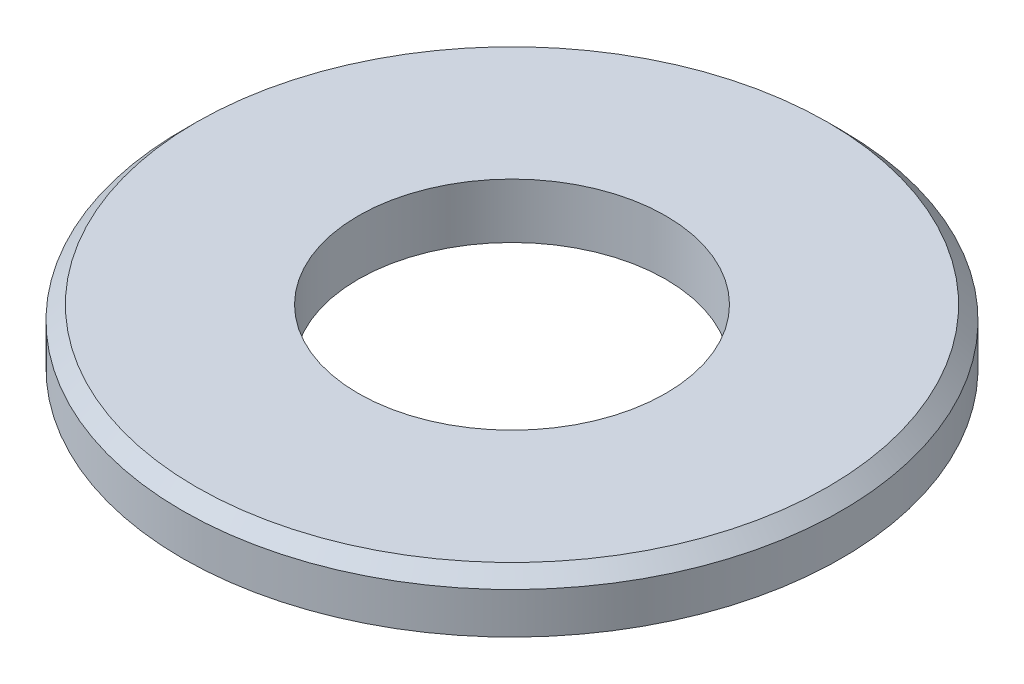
ISO-10303-21;
HEADER;
FILE_DESCRIPTION(('STEP AP214'),'2;1');
FILE_NAME('part.step','',(''),(''),'','','');
FILE_SCHEMA(('AUTOMOTIVE_DESIGN { 1 0 10303 214 1 1 1 1 }'));
ENDSEC;
DATA;
#1=APPLICATION_CONTEXT('core data for automotive mechanical design processes');
#2=APPLICATION_PROTOCOL_DEFINITION('international standard','automotive_design',2000,#1);
#3=PRODUCT_CONTEXT('',#1,'mechanical');
#4=PRODUCT('Part','Part','',(#3));
#5=PRODUCT_RELATED_PRODUCT_CATEGORY('part','',(#4));
#6=PRODUCT_DEFINITION_FORMATION('','',#4);
#7=PRODUCT_DEFINITION_CONTEXT('part definition',#1,'design');
#8=PRODUCT_DEFINITION('design','',#6,#7);
#9=PRODUCT_DEFINITION_SHAPE('','',#8);
#10=(LENGTH_UNIT() NAMED_UNIT(*) SI_UNIT(.MILLI.,.METRE.));
#11=(NAMED_UNIT(*) PLANE_ANGLE_UNIT() SI_UNIT($,.RADIAN.));
#12=(NAMED_UNIT(*) SI_UNIT($,.STERADIAN.) SOLID_ANGLE_UNIT());
#13=UNCERTAINTY_MEASURE_WITH_UNIT(LENGTH_MEASURE(1.E-05),#10,'distance_accuracy_value','');
#14=(GEOMETRIC_REPRESENTATION_CONTEXT(3) GLOBAL_UNCERTAINTY_ASSIGNED_CONTEXT((#13)) GLOBAL_UNIT_ASSIGNED_CONTEXT((#10,
#11,#12)) REPRESENTATION_CONTEXT('',''));
#15=CARTESIAN_POINT('',(0.,0.,0.));
#16=DIRECTION('',(0.,0.,1.));
#17=DIRECTION('',(1.,0.,0.));
#18=AXIS2_PLACEMENT_3D('',#15,#16,#17);
#19=CARTESIAN_POINT('',(0.,1.5,0.));
#20=DIRECTION('',(0.,1.,0.));
#21=DIRECTION('',(0.,0.,1.));
#22=AXIS2_PLACEMENT_3D('',#19,#20,#21);
#23=PLANE('',#22);
#24=CARTESIAN_POINT('',(0.,1.5,0.));
#25=DIRECTION('',(0.,1.,0.));
#26=DIRECTION('',(0.,0.,1.));
#27=AXIS2_PLACEMENT_3D('',#24,#25,#26);
#28=CIRCLE('',#27,8.625);
#29=CARTESIAN_POINT('',(0.,1.5,-8.625));
#30=VERTEX_POINT('',#29);
#31=EDGE_CURVE('E46',#30,#30,#28,.T.);
#32=ORIENTED_EDGE('',*,*,#31,.T.);
#33=EDGE_LOOP('',(#32));
#34=FACE_BOUND('',#33,.T.);
#35=CARTESIAN_POINT('',(0.,1.5,0.));
#36=DIRECTION('',(0.,1.,0.));
#37=DIRECTION('',(0.,0.,1.));
#38=AXIS2_PLACEMENT_3D('',#35,#36,#37);
#39=CIRCLE('',#38,4.2);
#40=CARTESIAN_POINT('',(0.,1.5,4.2));
#41=VERTEX_POINT('',#40);
#42=EDGE_CURVE('E57',#41,#41,#39,.T.);
#43=ORIENTED_EDGE('',*,*,#42,.F.);
#44=EDGE_LOOP('',(#43));
#45=FACE_BOUND('',#44,.T.);
#46=ADVANCED_FACE('F38',(#34,#45),#23,.T.);
#47=CARTESIAN_POINT('',(0.,0.,0.));
#48=DIRECTION('',(0.,1.,0.));
#49=DIRECTION('',(0.,0.,1.));
#50=AXIS2_PLACEMENT_3D('',#47,#48,#49);
#51=PLANE('',#50);
#52=CARTESIAN_POINT('',(0.,0.,0.));
#53=DIRECTION('',(0.,1.,0.));
#54=DIRECTION('',(0.,0.,1.));
#55=AXIS2_PLACEMENT_3D('',#52,#53,#54);
#56=CIRCLE('',#55,9.);
#57=CARTESIAN_POINT('',(0.,0.,9.));
#58=VERTEX_POINT('',#57);
#59=EDGE_CURVE('E51',#58,#58,#56,.T.);
#60=ORIENTED_EDGE('',*,*,#59,.F.);
#61=EDGE_LOOP('',(#60));
#62=FACE_BOUND('',#61,.T.);
#63=CARTESIAN_POINT('',(0.,0.,0.));
#64=DIRECTION('',(0.,1.,0.));
#65=DIRECTION('',(0.,0.,1.));
#66=AXIS2_PLACEMENT_3D('',#63,#64,#65);
#67=CIRCLE('',#66,4.2);
#68=CARTESIAN_POINT('',(0.,0.,4.2));
#69=VERTEX_POINT('',#68);
#70=EDGE_CURVE('E60',#69,#69,#67,.T.);
#71=ORIENTED_EDGE('',*,*,#70,.T.);
#72=EDGE_LOOP('',(#71));
#73=FACE_BOUND('',#72,.T.);
#74=ADVANCED_FACE('F71',(#62,#73),#51,.F.);
#75=CARTESIAN_POINT('',(0.,1.5,0.));
#76=DIRECTION('',(0.,-1.,0.));
#77=DIRECTION('',(0.,0.,-1.));
#78=AXIS2_PLACEMENT_3D('',#75,#76,#77);
#79=CYLINDRICAL_SURFACE('',#78,9.);
#80=CARTESIAN_POINT('',(0.,1.125,0.));
#81=DIRECTION('',(0.,1.,0.));
#82=DIRECTION('',(0.,0.,1.));
#83=AXIS2_PLACEMENT_3D('',#80,#81,#82);
#84=CIRCLE('',#83,9.);
#85=CARTESIAN_POINT('',(0.,1.125,-9.));
#86=VERTEX_POINT('',#85);
#87=EDGE_CURVE('E10',#86,#86,#84,.F.);
#88=ORIENTED_EDGE('',*,*,#87,.T.);
#89=EDGE_LOOP('',(#88));
#90=FACE_BOUND('',#89,.T.);
#91=ORIENTED_EDGE('',*,*,#59,.T.);
#92=EDGE_LOOP('',(#91));
#93=FACE_BOUND('',#92,.T.);
#94=ADVANCED_FACE('F75',(#90,#93),#79,.T.);
#95=CARTESIAN_POINT('',(0.,1.5,0.));
#96=DIRECTION('',(0.,-1.,0.));
#97=DIRECTION('',(0.,0.,-1.));
#98=AXIS2_PLACEMENT_3D('',#95,#96,#97);
#99=CYLINDRICAL_SURFACE('',#98,4.2);
#100=ORIENTED_EDGE('',*,*,#42,.T.);
#101=EDGE_LOOP('',(#100));
#102=FACE_BOUND('',#101,.T.);
#103=ORIENTED_EDGE('',*,*,#70,.F.);
#104=EDGE_LOOP('',(#103));
#105=FACE_BOUND('',#104,.T.);
#106=ADVANCED_FACE('F67',(#102,#105),#99,.F.);
#107=CARTESIAN_POINT('',(0.,1.5,0.));
#108=DIRECTION('',(0.,-1.,0.));
#109=DIRECTION('',(0.,0.,-1.));
#110=AXIS2_PLACEMENT_3D('',#107,#108,#109);
#111=CONICAL_SURFACE('',#110,8.625,0.785398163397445);
#112=CARTESIAN_POINT('',(0.,1.125,-9.));
#113=CARTESIAN_POINT('',(0.,1.12890625,-8.99609375));
#114=CARTESIAN_POINT('',(0.,1.1328125,-8.9921875));
#115=CARTESIAN_POINT('',(0.,1.140625,-8.984375));
#116=CARTESIAN_POINT('',(0.,1.14453125,-8.98046875));
#117=CARTESIAN_POINT('',(0.,1.15234375,-8.97265625));
#118=CARTESIAN_POINT('',(0.,1.15625,-8.96875));
#119=CARTESIAN_POINT('',(0.,1.1640625,-8.9609375));
#120=CARTESIAN_POINT('',(0.,1.16796875,-8.95703125));
#121=CARTESIAN_POINT('',(0.,1.17578125,-8.94921875));
#122=CARTESIAN_POINT('',(0.,1.1796875,-8.9453125));
#123=CARTESIAN_POINT('',(0.,1.1875,-8.9375));
#124=CARTESIAN_POINT('',(0.,1.19140625,-8.93359375));
#125=CARTESIAN_POINT('',(0.,1.19921875,-8.92578125));
#126=CARTESIAN_POINT('',(0.,1.203125,-8.921875));
#127=CARTESIAN_POINT('',(0.,1.2109375,-8.9140625));
#128=CARTESIAN_POINT('',(0.,1.21484375,-8.91015625));
#129=CARTESIAN_POINT('',(0.,1.22265625,-8.90234375));
#130=CARTESIAN_POINT('',(0.,1.2265625,-8.8984375));
#131=CARTESIAN_POINT('',(0.,1.234375,-8.890625));
#132=CARTESIAN_POINT('',(0.,1.23828125,-8.88671875));
#133=CARTESIAN_POINT('',(0.,1.24609375,-8.87890625));
#134=CARTESIAN_POINT('',(0.,1.25,-8.875));
#135=CARTESIAN_POINT('',(0.,1.2578125,-8.8671875));
#136=CARTESIAN_POINT('',(0.,1.26171875,-8.86328125));
#137=CARTESIAN_POINT('',(0.,1.26953125,-8.85546875));
#138=CARTESIAN_POINT('',(0.,1.2734375,-8.8515625));
#139=CARTESIAN_POINT('',(0.,1.28125,-8.84375));
#140=CARTESIAN_POINT('',(0.,1.28515625,-8.83984375));
#141=CARTESIAN_POINT('',(0.,1.29296875,-8.83203125));
#142=CARTESIAN_POINT('',(0.,1.296875,-8.828125));
#143=CARTESIAN_POINT('',(0.,1.3046875,-8.8203125));
#144=CARTESIAN_POINT('',(0.,1.30859375,-8.81640625));
#145=CARTESIAN_POINT('',(0.,1.31640625,-8.80859375));
#146=CARTESIAN_POINT('',(0.,1.3203125,-8.8046875));
#147=CARTESIAN_POINT('',(0.,1.328125,-8.796875));
#148=CARTESIAN_POINT('',(0.,1.33203125,-8.79296875));
#149=CARTESIAN_POINT('',(0.,1.33984375,-8.78515625));
#150=CARTESIAN_POINT('',(0.,1.34375,-8.78125));
#151=CARTESIAN_POINT('',(0.,1.3515625,-8.7734375));
#152=CARTESIAN_POINT('',(0.,1.35546875,-8.76953125));
#153=CARTESIAN_POINT('',(0.,1.36328125,-8.76171875));
#154=CARTESIAN_POINT('',(0.,1.3671875,-8.7578125));
#155=CARTESIAN_POINT('',(0.,1.375,-8.75));
#156=CARTESIAN_POINT('',(0.,1.37890625,-8.74609375));
#157=CARTESIAN_POINT('',(0.,1.38671875,-8.73828125));
#158=CARTESIAN_POINT('',(0.,1.390625,-8.734375));
#159=CARTESIAN_POINT('',(0.,1.3984375,-8.7265625));
#160=CARTESIAN_POINT('',(0.,1.40234375,-8.72265625));
#161=CARTESIAN_POINT('',(0.,1.41015625,-8.71484375));
#162=CARTESIAN_POINT('',(0.,1.4140625,-8.7109375));
#163=CARTESIAN_POINT('',(0.,1.421875,-8.703125));
#164=CARTESIAN_POINT('',(0.,1.42578125,-8.69921875));
#165=CARTESIAN_POINT('',(0.,1.43359375,-8.69140625));
#166=CARTESIAN_POINT('',(0.,1.4375,-8.6875));
#167=CARTESIAN_POINT('',(0.,1.4453125,-8.6796875));
#168=CARTESIAN_POINT('',(0.,1.44921875,-8.67578125));
#169=CARTESIAN_POINT('',(0.,1.45703125,-8.66796875));
#170=CARTESIAN_POINT('',(0.,1.4609375,-8.6640625));
#171=CARTESIAN_POINT('',(0.,1.46875,-8.65625));
#172=CARTESIAN_POINT('',(0.,1.47265625,-8.65234375));
#173=CARTESIAN_POINT('',(0.,1.48046875,-8.64453125));
#174=CARTESIAN_POINT('',(0.,1.484375,-8.640625));
#175=CARTESIAN_POINT('',(0.,1.4921875,-8.6328125));
#176=CARTESIAN_POINT('',(0.,1.49609375,-8.62890625));
#177=CARTESIAN_POINT('',(0.,1.5,-8.625));
#178=B_SPLINE_CURVE_WITH_KNOTS('',3,(#112,#113,#114,#115,#116,#117,#118,#119,#120,#121,#122,
#123,#124,#125,#126,#127,#128,#129,#130,#131,#132,#133,#134,#135,#136,#137,#138,#139,#140,#141,
#142,#143,#144,#145,#146,#147,#148,#149,#150,#151,#152,#153,#154,#155,#156,#157,#158,#159,#160,
#161,#162,#163,#164,#165,#166,#167,#168,#169,#170,#171,#172,#173,#174,#175,#176,#177),
.UNSPECIFIED.,.F.,.F.,(4,2,2,2,2,2,2,2,2,2,2,2,2,2,2,2,2,2,2,2,2,2,2,2,2,2,2,2,2,2,2,2,4),(0.,
0.01657281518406,0.033145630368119,0.049718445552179,0.066291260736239,0.0828640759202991,
0.0994368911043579,0.116009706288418,0.132582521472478,0.149155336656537,0.165728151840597,
0.182300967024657,0.198873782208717,0.215446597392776,0.232019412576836,0.248592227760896,
0.265165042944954,0.281737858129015,0.298310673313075,0.314883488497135,0.331456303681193,
0.348029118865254,0.364601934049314,0.381174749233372,0.397747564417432,0.414320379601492,
0.430893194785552,0.447466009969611,0.464038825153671,0.480611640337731,0.49718445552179,
0.51375727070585,0.53033008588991),.UNSPECIFIED.);
#179=EDGE_CURVE('BSEAM40',#86,#30,#178,.T.);
#180=ORIENTED_EDGE('',*,*,#87,.F.);
#181=ORIENTED_EDGE('',*,*,#31,.F.);
#182=ORIENTED_EDGE('',*,*,#179,.T.);
#183=ORIENTED_EDGE('',*,*,#179,.F.);
#184=EDGE_LOOP('',(#180,#182,#181,#183));
#185=FACE_BOUND('',#184,.T.);
#186=ADVANCED_FACE('F40',(#185),#111,.T.);
#187=CLOSED_SHELL('',(#46,#74,#94,#106,#186));
#188=MANIFOLD_SOLID_BREP('B2',#187);
#189=ADVANCED_BREP_SHAPE_REPRESENTATION('',(#18,#188),#14);
#190=SHAPE_DEFINITION_REPRESENTATION(#9,#189);
ENDSEC;
END-ISO-10303-21;
